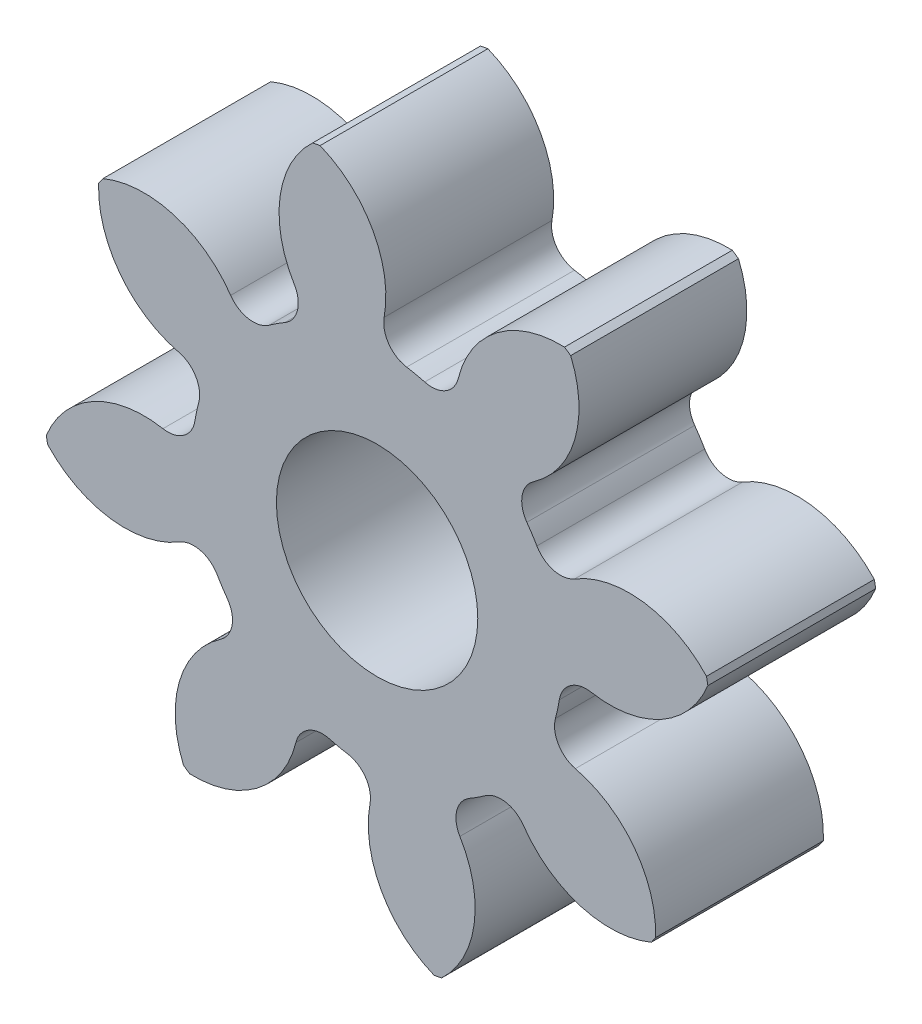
from build123d import *

# Parameters (mm, degrees)
SKETCH3_R         = 254
GEARBODY_DEPTH    = 127
TOOTHCUT_DEPTH    = 382
CIRPATTERN1_COUNT = 8
BOREDIA_R         = 76.2
BORE_DEPTH        = 12700


with BuildPart() as part:
    # Sketch3 → gearBody (new body)
    with BuildSketch(Plane.XY):
        Circle(SKETCH3_R)
    extrude(amount=GEARBODY_DEPTH)

    # Sketch2 → toothCut (cut, through all)
    with BuildSketch(Plane.XY):
        with BuildLine():
            ThreePointArc((134.976081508, -36.021485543), (136.606604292, -29.235691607), (137.896202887, -22.376935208))
            ThreePointArc((137.896202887, -22.376935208), (146.387638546, -8.793138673), (162.033179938, -5.352057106))
            ThreePointArc((162.033179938, -5.352057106), (220.011217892, 6.318491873), (254, 54.717017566))
            ThreePointArc((254, 54.717017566), (254.073394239, -54.37519978), (209.356988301, -153.881784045))
            ThreePointArc((209.356988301, -153.881784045), (198.153975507, -95.811592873), (150.030885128, -61.433943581))
            ThreePointArc((150.030885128, -61.433943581), (137.164137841, -51.890840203), (134.976081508, -36.021485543))
        make_face()
    toothcut = extrude(amount=TOOTHCUT_DEPTH, mode=Mode.SUBTRACT)

    # CirPattern1: toothCut ×8 about axis
    cirpattern1_axis = Axis((0, 0, 0), (0, 0, 1))
    for i in range(1, CIRPATTERN1_COUNT):
        add(toothcut.rotate(cirpattern1_axis, i * 360 / CIRPATTERN1_COUNT), mode=Mode.SUBTRACT)

    # boreDia → bore (cut, symmetric)
    with BuildSketch(Plane.XY):
        Circle(BOREDIA_R)
    extrude(amount=BORE_DEPTH, both=True, mode=Mode.SUBTRACT)


solid = part.part
